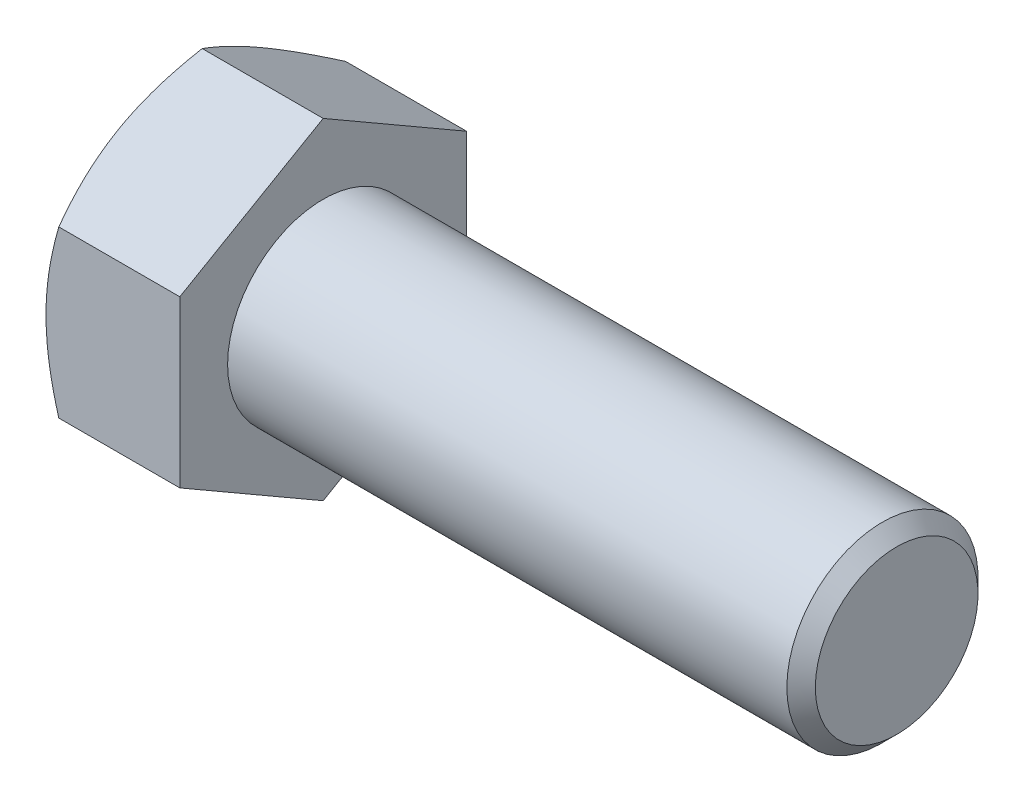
from build123d import *

# Parameters (mm, degrees)
BASEHEAD_DEPTH = 17.78


with BuildPart() as part:
    # Sketch1 → BaseHead (new body)
    with BuildSketch(Plane(origin=(0, 0, 0), x_dir=(0, 0, -1), z_dir=(1, 0, 0))):
        Polygon((19.05, 10.998522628), (19.05, -10.998522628), (0, -21.997045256), (-19.05, -10.998522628), (-19.05, 10.998522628), (0, 21.997045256), align=None)
    extrude(amount=BASEHEAD_DEPTH)

    # BodySke → BaseBody (revolve)
    with BuildSketch(Plane.XY, mode=Mode.PRIVATE) as basebody_sk:
        Polygon((0, 0), (93.98, 0), (93.98, 10.8077), (92.0877, 12.7), (0, 12.7), align=None)
    revolve(basebody_sk.sketch.rotate(Axis((0, 0, 0), (1, 0, 0)), 90), axis=Axis((0, 0, 0), (1, 0, 0)))

    # Sketch3 → HeadChamfer (revolve, cut)
    with BuildSketch(Plane.XY):
        Polygon((0, 19.05), (5.367651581, 28.347045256), (5.367651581, 34.697045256), (-12.7, 34.697045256), (-12.7, 19.05), align=None)
    revolve(axis=Axis((0, 0, 0), (1, 0, 0)), mode=Mode.SUBTRACT)


solid = part.part
